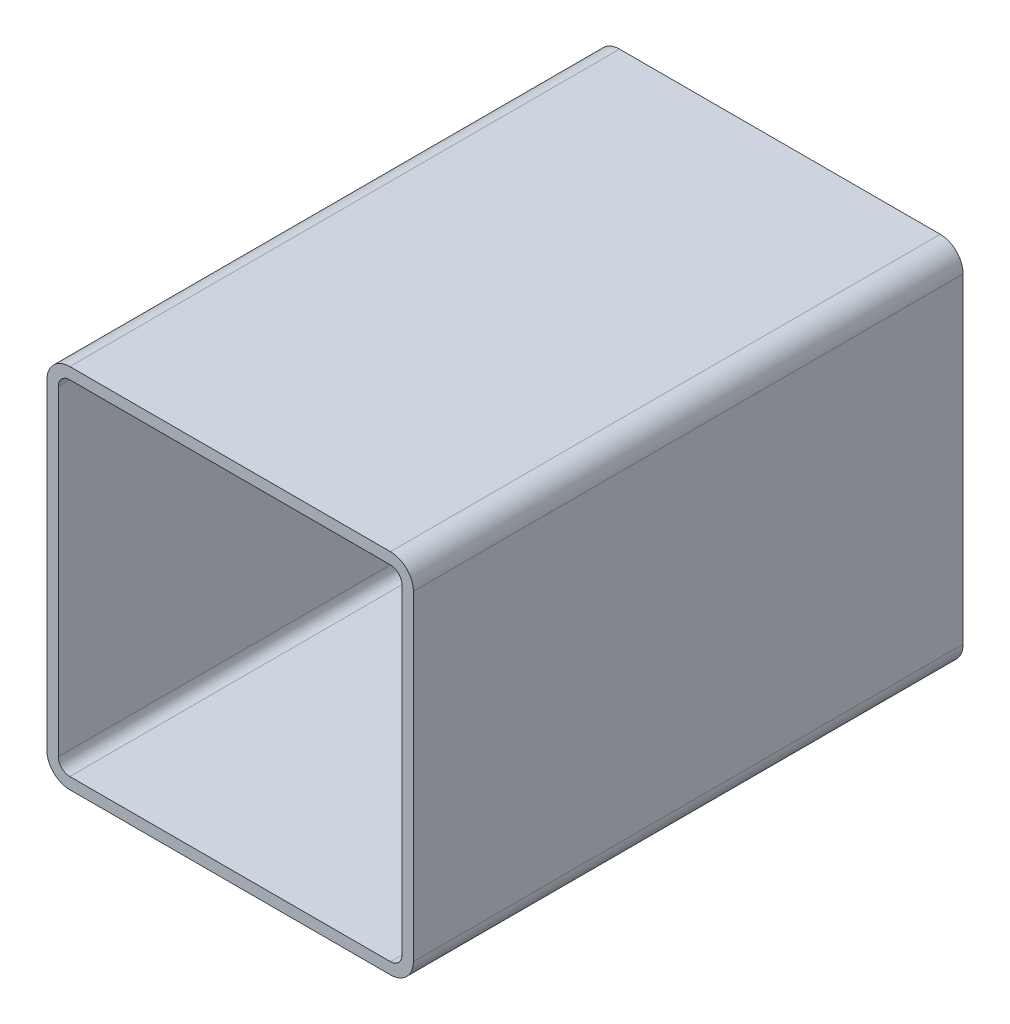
ISO-10303-21;
HEADER;
FILE_DESCRIPTION(('STEP AP214'),'2;1');
FILE_NAME('part.step','',(''),(''),'','','');
FILE_SCHEMA(('AUTOMOTIVE_DESIGN { 1 0 10303 214 1 1 1 1 }'));
ENDSEC;
DATA;
#1=APPLICATION_CONTEXT('core data for automotive mechanical design processes');
#2=APPLICATION_PROTOCOL_DEFINITION('international standard','automotive_design',2000,#1);
#3=PRODUCT_CONTEXT('',#1,'mechanical');
#4=PRODUCT('Part','Part','',(#3));
#5=PRODUCT_RELATED_PRODUCT_CATEGORY('part','',(#4));
#6=PRODUCT_DEFINITION_FORMATION('','',#4);
#7=PRODUCT_DEFINITION_CONTEXT('part definition',#1,'design');
#8=PRODUCT_DEFINITION('design','',#6,#7);
#9=PRODUCT_DEFINITION_SHAPE('','',#8);
#10=(LENGTH_UNIT() NAMED_UNIT(*) SI_UNIT(.MILLI.,.METRE.));
#11=(NAMED_UNIT(*) PLANE_ANGLE_UNIT() SI_UNIT($,.RADIAN.));
#12=(NAMED_UNIT(*) SI_UNIT($,.STERADIAN.) SOLID_ANGLE_UNIT());
#13=UNCERTAINTY_MEASURE_WITH_UNIT(LENGTH_MEASURE(1.E-05),#10,'distance_accuracy_value','');
#14=(GEOMETRIC_REPRESENTATION_CONTEXT(3) GLOBAL_UNCERTAINTY_ASSIGNED_CONTEXT((#13)) GLOBAL_UNIT_ASSIGNED_CONTEXT((#10,
#11,#12)) REPRESENTATION_CONTEXT('',''));
#15=CARTESIAN_POINT('',(0.,0.,0.));
#16=DIRECTION('',(0.,0.,1.));
#17=DIRECTION('',(1.,0.,0.));
#18=AXIS2_PLACEMENT_3D('',#15,#16,#17);
#19=CARTESIAN_POINT('',(14.0909404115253,192.466130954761,304.8));
#20=DIRECTION('',(0.,0.,1.));
#21=DIRECTION('',(1.,0.,0.));
#22=AXIS2_PLACEMENT_3D('',#19,#20,#21);
#23=PLANE('',#22);
#24=CARTESIAN_POINT('',(14.0909404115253,192.466130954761,304.8));
#25=DIRECTION('',(0.,0.,1.));
#26=DIRECTION('',(1.,0.,0.));
#27=AXIS2_PLACEMENT_3D('',#24,#25,#26);
#28=CIRCLE('',#27,12.7);
#29=CARTESIAN_POINT('',(14.0909404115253,205.166130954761,304.8));
#30=VERTEX_POINT('',#29);
#31=CARTESIAN_POINT('',(1.3909404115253,192.466130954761,304.8));
#32=VERTEX_POINT('',#31);
#33=EDGE_CURVE('E211',#30,#32,#28,.T.);
#34=ORIENTED_EDGE('',*,*,#33,.T.);
#35=DIRECTION('',(0.,-1.,0.));
#36=VECTOR('',#35,1.);
#37=CARTESIAN_POINT('',(1.3909404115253,14.6661309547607,304.8));
#38=LINE('',#37,#36);
#39=CARTESIAN_POINT('',(1.3909404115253,14.6661309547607,304.8));
#40=VERTEX_POINT('',#39);
#41=EDGE_CURVE('E214',#32,#40,#38,.T.);
#42=ORIENTED_EDGE('',*,*,#41,.T.);
#43=CARTESIAN_POINT('',(14.0909404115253,14.6661309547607,304.8));
#44=DIRECTION('',(0.,0.,1.));
#45=DIRECTION('',(1.,0.,0.));
#46=AXIS2_PLACEMENT_3D('',#43,#44,#45);
#47=CIRCLE('',#46,12.7);
#48=CARTESIAN_POINT('',(14.0909404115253,1.96613095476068,304.8));
#49=VERTEX_POINT('',#48);
#50=EDGE_CURVE('E217',#40,#49,#47,.T.);
#51=ORIENTED_EDGE('',*,*,#50,.T.);
#52=DIRECTION('',(1.,0.,0.));
#53=VECTOR('',#52,1.);
#54=CARTESIAN_POINT('',(191.890940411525,1.96613095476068,304.8));
#55=LINE('',#54,#53);
#56=CARTESIAN_POINT('',(191.890940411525,1.96613095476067,304.8));
#57=VERTEX_POINT('',#56);
#58=EDGE_CURVE('E219',#49,#57,#55,.T.);
#59=ORIENTED_EDGE('',*,*,#58,.T.);
#60=CARTESIAN_POINT('',(191.890940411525,14.6661309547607,304.8));
#61=DIRECTION('',(0.,0.,1.));
#62=DIRECTION('',(1.,0.,0.));
#63=AXIS2_PLACEMENT_3D('',#60,#61,#62);
#64=CIRCLE('',#63,12.7);
#65=CARTESIAN_POINT('',(204.590940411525,14.6661309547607,304.8));
#66=VERTEX_POINT('',#65);
#67=EDGE_CURVE('E221',#57,#66,#64,.T.);
#68=ORIENTED_EDGE('',*,*,#67,.T.);
#69=DIRECTION('',(0.,1.,0.));
#70=VECTOR('',#69,1.);
#71=CARTESIAN_POINT('',(204.590940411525,192.466130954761,304.8));
#72=LINE('',#71,#70);
#73=CARTESIAN_POINT('',(204.590940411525,192.466130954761,304.8));
#74=VERTEX_POINT('',#73);
#75=EDGE_CURVE('E223',#66,#74,#72,.T.);
#76=ORIENTED_EDGE('',*,*,#75,.T.);
#77=CARTESIAN_POINT('',(191.890940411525,192.466130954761,304.8));
#78=DIRECTION('',(0.,0.,1.));
#79=DIRECTION('',(1.,0.,0.));
#80=AXIS2_PLACEMENT_3D('',#77,#78,#79);
#81=CIRCLE('',#80,12.7);
#82=CARTESIAN_POINT('',(191.890940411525,205.166130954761,304.8));
#83=VERTEX_POINT('',#82);
#84=EDGE_CURVE('E225',#74,#83,#81,.T.);
#85=ORIENTED_EDGE('',*,*,#84,.T.);
#86=DIRECTION('',(-1.,0.,0.));
#87=VECTOR('',#86,1.);
#88=CARTESIAN_POINT('',(14.0909404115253,205.166130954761,304.8));
#89=LINE('',#88,#87);
#90=EDGE_CURVE('E227',#83,#30,#89,.T.);
#91=ORIENTED_EDGE('',*,*,#90,.T.);
#92=EDGE_LOOP('',(#34,#42,#51,#59,#68,#76,#85,#91));
#93=FACE_BOUND('',#92,.T.);
#94=DIRECTION('',(0.,-1.,0.));
#95=VECTOR('',#94,1.);
#96=CARTESIAN_POINT('',(7.7409404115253,14.6661309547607,304.8));
#97=LINE('',#96,#95);
#98=CARTESIAN_POINT('',(7.7409404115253,192.466130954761,304.8));
#99=VERTEX_POINT('',#98);
#100=CARTESIAN_POINT('',(7.7409404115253,14.6661309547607,304.8));
#101=VERTEX_POINT('',#100);
#102=EDGE_CURVE('E154',#99,#101,#97,.T.);
#103=ORIENTED_EDGE('',*,*,#102,.F.);
#104=CARTESIAN_POINT('',(14.0909404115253,192.466130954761,304.8));
#105=DIRECTION('',(0.,0.,1.));
#106=DIRECTION('',(1.,0.,0.));
#107=AXIS2_PLACEMENT_3D('',#104,#105,#106);
#108=CIRCLE('',#107,6.35000000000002);
#109=CARTESIAN_POINT('',(14.0909404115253,198.816130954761,304.8));
#110=VERTEX_POINT('',#109);
#111=EDGE_CURVE('E146',#110,#99,#108,.T.);
#112=ORIENTED_EDGE('',*,*,#111,.F.);
#113=DIRECTION('',(-1.,0.,0.));
#114=VECTOR('',#113,1.);
#115=CARTESIAN_POINT('',(14.0909404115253,198.816130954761,304.8));
#116=LINE('',#115,#114);
#117=CARTESIAN_POINT('',(191.890940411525,198.816130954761,304.8));
#118=VERTEX_POINT('',#117);
#119=EDGE_CURVE('E179',#118,#110,#116,.T.);
#120=ORIENTED_EDGE('',*,*,#119,.F.);
#121=CARTESIAN_POINT('',(191.890940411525,192.466130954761,304.8));
#122=DIRECTION('',(0.,0.,1.));
#123=DIRECTION('',(1.,0.,0.));
#124=AXIS2_PLACEMENT_3D('',#121,#122,#123);
#125=CIRCLE('',#124,6.35000000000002);
#126=CARTESIAN_POINT('',(198.240940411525,192.466130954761,304.8));
#127=VERTEX_POINT('',#126);
#128=EDGE_CURVE('E177',#127,#118,#125,.T.);
#129=ORIENTED_EDGE('',*,*,#128,.F.);
#130=DIRECTION('',(0.,1.,0.));
#131=VECTOR('',#130,1.);
#132=CARTESIAN_POINT('',(198.240940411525,192.466130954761,304.8));
#133=LINE('',#132,#131);
#134=CARTESIAN_POINT('',(198.240940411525,14.6661309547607,304.8));
#135=VERTEX_POINT('',#134);
#136=EDGE_CURVE('E175',#135,#127,#133,.T.);
#137=ORIENTED_EDGE('',*,*,#136,.F.);
#138=CARTESIAN_POINT('',(191.890940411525,14.6661309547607,304.8));
#139=DIRECTION('',(0.,0.,1.));
#140=DIRECTION('',(1.,0.,0.));
#141=AXIS2_PLACEMENT_3D('',#138,#139,#140);
#142=CIRCLE('',#141,6.35000000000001);
#143=CARTESIAN_POINT('',(191.890940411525,8.31613095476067,304.8));
#144=VERTEX_POINT('',#143);
#145=EDGE_CURVE('E173',#144,#135,#142,.T.);
#146=ORIENTED_EDGE('',*,*,#145,.F.);
#147=DIRECTION('',(1.,0.,0.));
#148=VECTOR('',#147,1.);
#149=CARTESIAN_POINT('',(191.890940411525,8.31613095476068,304.8));
#150=LINE('',#149,#148);
#151=CARTESIAN_POINT('',(14.0909404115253,8.31613095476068,304.8));
#152=VERTEX_POINT('',#151);
#153=EDGE_CURVE('E169',#152,#144,#150,.T.);
#154=ORIENTED_EDGE('',*,*,#153,.F.);
#155=CARTESIAN_POINT('',(14.0909404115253,14.6661309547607,304.8));
#156=DIRECTION('',(0.,0.,1.));
#157=DIRECTION('',(1.,0.,0.));
#158=AXIS2_PLACEMENT_3D('',#155,#156,#157);
#159=CIRCLE('',#158,6.35);
#160=EDGE_CURVE('E167',#101,#152,#159,.T.);
#161=ORIENTED_EDGE('',*,*,#160,.F.);
#162=EDGE_LOOP('',(#103,#112,#120,#129,#137,#146,#154,#161));
#163=FACE_BOUND('',#162,.T.);
#164=ADVANCED_FACE('F33',(#93,#163),#23,.T.);
#165=CARTESIAN_POINT('',(14.0909404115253,192.466130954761,0.));
#166=DIRECTION('',(0.,0.,1.));
#167=DIRECTION('',(1.,0.,0.));
#168=AXIS2_PLACEMENT_3D('',#165,#166,#167);
#169=PLANE('',#168);
#170=CARTESIAN_POINT('',(14.0909404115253,192.466130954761,0.));
#171=DIRECTION('',(0.,0.,1.));
#172=DIRECTION('',(1.,0.,0.));
#173=AXIS2_PLACEMENT_3D('',#170,#171,#172);
#174=CIRCLE('',#173,12.7);
#175=CARTESIAN_POINT('',(14.0909404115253,205.166130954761,0.));
#176=VERTEX_POINT('',#175);
#177=CARTESIAN_POINT('',(1.3909404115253,192.466130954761,0.));
#178=VERTEX_POINT('',#177);
#179=EDGE_CURVE('E162',#176,#178,#174,.T.);
#180=ORIENTED_EDGE('',*,*,#179,.F.);
#181=DIRECTION('',(-1.,0.,0.));
#182=VECTOR('',#181,1.);
#183=CARTESIAN_POINT('',(14.0909404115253,205.166130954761,0.));
#184=LINE('',#183,#182);
#185=CARTESIAN_POINT('',(191.890940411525,205.166130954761,0.));
#186=VERTEX_POINT('',#185);
#187=EDGE_CURVE('E215',#186,#176,#184,.T.);
#188=ORIENTED_EDGE('',*,*,#187,.F.);
#189=CARTESIAN_POINT('',(191.890940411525,192.466130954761,0.));
#190=DIRECTION('',(0.,0.,1.));
#191=DIRECTION('',(1.,0.,0.));
#192=AXIS2_PLACEMENT_3D('',#189,#190,#191);
#193=CIRCLE('',#192,12.7);
#194=CARTESIAN_POINT('',(204.590940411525,192.466130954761,0.));
#195=VERTEX_POINT('',#194);
#196=EDGE_CURVE('E242',#195,#186,#193,.T.);
#197=ORIENTED_EDGE('',*,*,#196,.F.);
#198=DIRECTION('',(0.,1.,0.));
#199=VECTOR('',#198,1.);
#200=CARTESIAN_POINT('',(204.590940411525,192.466130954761,0.));
#201=LINE('',#200,#199);
#202=CARTESIAN_POINT('',(204.590940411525,14.6661309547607,0.));
#203=VERTEX_POINT('',#202);
#204=EDGE_CURVE('E240',#203,#195,#201,.T.);
#205=ORIENTED_EDGE('',*,*,#204,.F.);
#206=CARTESIAN_POINT('',(191.890940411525,14.6661309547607,0.));
#207=DIRECTION('',(0.,0.,1.));
#208=DIRECTION('',(1.,0.,0.));
#209=AXIS2_PLACEMENT_3D('',#206,#207,#208);
#210=CIRCLE('',#209,12.7);
#211=CARTESIAN_POINT('',(191.890940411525,1.96613095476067,0.));
#212=VERTEX_POINT('',#211);
#213=EDGE_CURVE('E238',#212,#203,#210,.T.);
#214=ORIENTED_EDGE('',*,*,#213,.F.);
#215=DIRECTION('',(1.,0.,0.));
#216=VECTOR('',#215,1.);
#217=CARTESIAN_POINT('',(191.890940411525,1.96613095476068,0.));
#218=LINE('',#217,#216);
#219=CARTESIAN_POINT('',(14.0909404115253,1.96613095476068,0.));
#220=VERTEX_POINT('',#219);
#221=EDGE_CURVE('E236',#220,#212,#218,.T.);
#222=ORIENTED_EDGE('',*,*,#221,.F.);
#223=CARTESIAN_POINT('',(14.0909404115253,14.6661309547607,0.));
#224=DIRECTION('',(0.,0.,1.));
#225=DIRECTION('',(1.,0.,0.));
#226=AXIS2_PLACEMENT_3D('',#223,#224,#225);
#227=CIRCLE('',#226,12.7);
#228=CARTESIAN_POINT('',(1.3909404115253,14.6661309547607,0.));
#229=VERTEX_POINT('',#228);
#230=EDGE_CURVE('E234',#229,#220,#227,.T.);
#231=ORIENTED_EDGE('',*,*,#230,.F.);
#232=DIRECTION('',(0.,-1.,0.));
#233=VECTOR('',#232,1.);
#234=CARTESIAN_POINT('',(1.3909404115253,14.6661309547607,0.));
#235=LINE('',#234,#233);
#236=EDGE_CURVE('E232',#178,#229,#235,.T.);
#237=ORIENTED_EDGE('',*,*,#236,.F.);
#238=EDGE_LOOP('',(#180,#188,#197,#205,#214,#222,#231,#237));
#239=FACE_BOUND('',#238,.T.);
#240=CARTESIAN_POINT('',(14.0909404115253,192.466130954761,0.));
#241=DIRECTION('',(0.,0.,1.));
#242=DIRECTION('',(1.,0.,0.));
#243=AXIS2_PLACEMENT_3D('',#240,#241,#242);
#244=CIRCLE('',#243,6.35000000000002);
#245=CARTESIAN_POINT('',(14.0909404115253,198.816130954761,0.));
#246=VERTEX_POINT('',#245);
#247=CARTESIAN_POINT('',(7.7409404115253,192.466130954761,0.));
#248=VERTEX_POINT('',#247);
#249=EDGE_CURVE('E56',#246,#248,#244,.T.);
#250=ORIENTED_EDGE('',*,*,#249,.T.);
#251=DIRECTION('',(0.,-1.,0.));
#252=VECTOR('',#251,1.);
#253=CARTESIAN_POINT('',(7.7409404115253,14.6661309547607,0.));
#254=LINE('',#253,#252);
#255=CARTESIAN_POINT('',(7.7409404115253,14.6661309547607,0.));
#256=VERTEX_POINT('',#255);
#257=EDGE_CURVE('E161',#248,#256,#254,.T.);
#258=ORIENTED_EDGE('',*,*,#257,.T.);
#259=CARTESIAN_POINT('',(14.0909404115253,14.6661309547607,0.));
#260=DIRECTION('',(0.,0.,1.));
#261=DIRECTION('',(1.,0.,0.));
#262=AXIS2_PLACEMENT_3D('',#259,#260,#261);
#263=CIRCLE('',#262,6.35);
#264=CARTESIAN_POINT('',(14.0909404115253,8.31613095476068,0.));
#265=VERTEX_POINT('',#264);
#266=EDGE_CURVE('E183',#256,#265,#263,.T.);
#267=ORIENTED_EDGE('',*,*,#266,.T.);
#268=DIRECTION('',(1.,0.,0.));
#269=VECTOR('',#268,1.);
#270=CARTESIAN_POINT('',(191.890940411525,8.31613095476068,0.));
#271=LINE('',#270,#269);
#272=CARTESIAN_POINT('',(191.890940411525,8.31613095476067,0.));
#273=VERTEX_POINT('',#272);
#274=EDGE_CURVE('E186',#265,#273,#271,.T.);
#275=ORIENTED_EDGE('',*,*,#274,.T.);
#276=CARTESIAN_POINT('',(191.890940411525,14.6661309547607,0.));
#277=DIRECTION('',(0.,0.,1.));
#278=DIRECTION('',(1.,0.,0.));
#279=AXIS2_PLACEMENT_3D('',#276,#277,#278);
#280=CIRCLE('',#279,6.35000000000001);
#281=CARTESIAN_POINT('',(198.240940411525,14.6661309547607,0.));
#282=VERTEX_POINT('',#281);
#283=EDGE_CURVE('E189',#273,#282,#280,.T.);
#284=ORIENTED_EDGE('',*,*,#283,.T.);
#285=DIRECTION('',(0.,1.,0.));
#286=VECTOR('',#285,1.);
#287=CARTESIAN_POINT('',(198.240940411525,192.466130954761,0.));
#288=LINE('',#287,#286);
#289=CARTESIAN_POINT('',(198.240940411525,192.466130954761,0.));
#290=VERTEX_POINT('',#289);
#291=EDGE_CURVE('E192',#282,#290,#288,.T.);
#292=ORIENTED_EDGE('',*,*,#291,.T.);
#293=CARTESIAN_POINT('',(191.890940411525,192.466130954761,0.));
#294=DIRECTION('',(0.,0.,1.));
#295=DIRECTION('',(1.,0.,0.));
#296=AXIS2_PLACEMENT_3D('',#293,#294,#295);
#297=CIRCLE('',#296,6.35000000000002);
#298=CARTESIAN_POINT('',(191.890940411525,198.816130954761,0.));
#299=VERTEX_POINT('',#298);
#300=EDGE_CURVE('E195',#290,#299,#297,.T.);
#301=ORIENTED_EDGE('',*,*,#300,.T.);
#302=DIRECTION('',(-1.,0.,0.));
#303=VECTOR('',#302,1.);
#304=CARTESIAN_POINT('',(14.0909404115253,198.816130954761,0.));
#305=LINE('',#304,#303);
#306=EDGE_CURVE('E155',#299,#246,#305,.T.);
#307=ORIENTED_EDGE('',*,*,#306,.T.);
#308=EDGE_LOOP('',(#250,#258,#267,#275,#284,#292,#301,#307));
#309=FACE_BOUND('',#308,.T.);
#310=ADVANCED_FACE('F272',(#239,#309),#169,.F.);
#311=CARTESIAN_POINT('',(14.0909404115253,192.466130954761,304.8));
#312=DIRECTION('',(0.,0.,-1.));
#313=DIRECTION('',(-1.,0.,0.));
#314=AXIS2_PLACEMENT_3D('',#311,#312,#313);
#315=CYLINDRICAL_SURFACE('',#314,12.7);
#316=ORIENTED_EDGE('',*,*,#179,.T.);
#317=DIRECTION('',(0.,0.,-1.));
#318=VECTOR('',#317,1.);
#319=CARTESIAN_POINT('',(1.3909404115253,192.466130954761,304.8));
#320=LINE('',#319,#318);
#321=EDGE_CURVE('E11',#32,#178,#320,.T.);
#322=ORIENTED_EDGE('',*,*,#321,.F.);
#323=ORIENTED_EDGE('',*,*,#33,.F.);
#324=DIRECTION('',(0.,0.,-1.));
#325=VECTOR('',#324,1.);
#326=CARTESIAN_POINT('',(14.0909404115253,205.166130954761,304.8));
#327=LINE('',#326,#325);
#328=EDGE_CURVE('E229',#30,#176,#327,.T.);
#329=ORIENTED_EDGE('',*,*,#328,.T.);
#330=EDGE_LOOP('',(#316,#322,#323,#329));
#331=FACE_BOUND('',#330,.T.);
#332=ADVANCED_FACE('F35',(#331),#315,.T.);
#333=CARTESIAN_POINT('',(1.3909404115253,14.6661309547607,304.8));
#334=DIRECTION('',(1.,0.,0.));
#335=DIRECTION('',(0.,0.,-1.));
#336=AXIS2_PLACEMENT_3D('',#333,#334,#335);
#337=PLANE('',#336);
#338=ORIENTED_EDGE('',*,*,#236,.T.);
#339=DIRECTION('',(0.,0.,-1.));
#340=VECTOR('',#339,1.);
#341=CARTESIAN_POINT('',(1.3909404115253,14.6661309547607,304.8));
#342=LINE('',#341,#340);
#343=EDGE_CURVE('E41',#40,#229,#342,.T.);
#344=ORIENTED_EDGE('',*,*,#343,.F.);
#345=ORIENTED_EDGE('',*,*,#41,.F.);
#346=ORIENTED_EDGE('',*,*,#321,.T.);
#347=EDGE_LOOP('',(#338,#344,#345,#346));
#348=FACE_BOUND('',#347,.T.);
#349=ADVANCED_FACE('F289',(#348),#337,.F.);
#350=CARTESIAN_POINT('',(14.0909404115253,14.6661309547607,304.8));
#351=DIRECTION('',(0.,0.,-1.));
#352=DIRECTION('',(-1.,0.,0.));
#353=AXIS2_PLACEMENT_3D('',#350,#351,#352);
#354=CYLINDRICAL_SURFACE('',#353,12.7);
#355=ORIENTED_EDGE('',*,*,#230,.T.);
#356=DIRECTION('',(0.,0.,-1.));
#357=VECTOR('',#356,1.);
#358=CARTESIAN_POINT('',(14.0909404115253,1.96613095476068,304.8));
#359=LINE('',#358,#357);
#360=EDGE_CURVE('E259',#49,#220,#359,.T.);
#361=ORIENTED_EDGE('',*,*,#360,.F.);
#362=ORIENTED_EDGE('',*,*,#50,.F.);
#363=ORIENTED_EDGE('',*,*,#343,.T.);
#364=EDGE_LOOP('',(#355,#361,#362,#363));
#365=FACE_BOUND('',#364,.T.);
#366=ADVANCED_FACE('F266',(#365),#354,.T.);
#367=CARTESIAN_POINT('',(191.890940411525,1.96613095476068,304.8));
#368=DIRECTION('',(0.,1.,0.));
#369=DIRECTION('',(0.,0.,1.));
#370=AXIS2_PLACEMENT_3D('',#367,#368,#369);
#371=PLANE('',#370);
#372=ORIENTED_EDGE('',*,*,#221,.T.);
#373=DIRECTION('',(0.,0.,-1.));
#374=VECTOR('',#373,1.);
#375=CARTESIAN_POINT('',(191.890940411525,1.96613095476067,304.8));
#376=LINE('',#375,#374);
#377=EDGE_CURVE('E256',#57,#212,#376,.T.);
#378=ORIENTED_EDGE('',*,*,#377,.F.);
#379=ORIENTED_EDGE('',*,*,#58,.F.);
#380=ORIENTED_EDGE('',*,*,#360,.T.);
#381=EDGE_LOOP('',(#372,#378,#379,#380));
#382=FACE_BOUND('',#381,.T.);
#383=ADVANCED_FACE('F278',(#382),#371,.F.);
#384=CARTESIAN_POINT('',(191.890940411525,14.6661309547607,304.8));
#385=DIRECTION('',(0.,0.,-1.));
#386=DIRECTION('',(-1.,0.,0.));
#387=AXIS2_PLACEMENT_3D('',#384,#385,#386);
#388=CYLINDRICAL_SURFACE('',#387,12.7);
#389=ORIENTED_EDGE('',*,*,#213,.T.);
#390=DIRECTION('',(0.,0.,-1.));
#391=VECTOR('',#390,1.);
#392=CARTESIAN_POINT('',(204.590940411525,14.6661309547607,304.8));
#393=LINE('',#392,#391);
#394=EDGE_CURVE('E253',#66,#203,#393,.T.);
#395=ORIENTED_EDGE('',*,*,#394,.F.);
#396=ORIENTED_EDGE('',*,*,#67,.F.);
#397=ORIENTED_EDGE('',*,*,#377,.T.);
#398=EDGE_LOOP('',(#389,#395,#396,#397));
#399=FACE_BOUND('',#398,.T.);
#400=ADVANCED_FACE('F282',(#399),#388,.T.);
#401=CARTESIAN_POINT('',(204.590940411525,192.466130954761,304.8));
#402=DIRECTION('',(-1.,0.,0.));
#403=DIRECTION('',(0.,0.,1.));
#404=AXIS2_PLACEMENT_3D('',#401,#402,#403);
#405=PLANE('',#404);
#406=ORIENTED_EDGE('',*,*,#204,.T.);
#407=DIRECTION('',(0.,0.,-1.));
#408=VECTOR('',#407,1.);
#409=CARTESIAN_POINT('',(204.590940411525,192.466130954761,304.8));
#410=LINE('',#409,#408);
#411=EDGE_CURVE('E250',#74,#195,#410,.T.);
#412=ORIENTED_EDGE('',*,*,#411,.F.);
#413=ORIENTED_EDGE('',*,*,#75,.F.);
#414=ORIENTED_EDGE('',*,*,#394,.T.);
#415=EDGE_LOOP('',(#406,#412,#413,#414));
#416=FACE_BOUND('',#415,.T.);
#417=ADVANCED_FACE('F302',(#416),#405,.F.);
#418=CARTESIAN_POINT('',(191.890940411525,192.466130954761,304.8));
#419=DIRECTION('',(0.,0.,-1.));
#420=DIRECTION('',(-1.,0.,0.));
#421=AXIS2_PLACEMENT_3D('',#418,#419,#420);
#422=CYLINDRICAL_SURFACE('',#421,12.7);
#423=ORIENTED_EDGE('',*,*,#196,.T.);
#424=DIRECTION('',(0.,0.,-1.));
#425=VECTOR('',#424,1.);
#426=CARTESIAN_POINT('',(191.890940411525,205.166130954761,304.8));
#427=LINE('',#426,#425);
#428=EDGE_CURVE('E247',#83,#186,#427,.T.);
#429=ORIENTED_EDGE('',*,*,#428,.F.);
#430=ORIENTED_EDGE('',*,*,#84,.F.);
#431=ORIENTED_EDGE('',*,*,#411,.T.);
#432=EDGE_LOOP('',(#423,#429,#430,#431));
#433=FACE_BOUND('',#432,.T.);
#434=ADVANCED_FACE('F300',(#433),#422,.T.);
#435=CARTESIAN_POINT('',(14.0909404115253,205.166130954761,304.8));
#436=DIRECTION('',(0.,-1.,0.));
#437=DIRECTION('',(0.,0.,-1.));
#438=AXIS2_PLACEMENT_3D('',#435,#436,#437);
#439=PLANE('',#438);
#440=ORIENTED_EDGE('',*,*,#187,.T.);
#441=ORIENTED_EDGE('',*,*,#328,.F.);
#442=ORIENTED_EDGE('',*,*,#90,.F.);
#443=ORIENTED_EDGE('',*,*,#428,.T.);
#444=EDGE_LOOP('',(#440,#441,#442,#443));
#445=FACE_BOUND('',#444,.T.);
#446=ADVANCED_FACE('F295',(#445),#439,.F.);
#447=CARTESIAN_POINT('',(14.0909404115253,192.466130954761,304.8));
#448=DIRECTION('',(0.,0.,-1.));
#449=DIRECTION('',(-1.,0.,0.));
#450=AXIS2_PLACEMENT_3D('',#447,#448,#449);
#451=CYLINDRICAL_SURFACE('',#450,6.35000000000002);
#452=ORIENTED_EDGE('',*,*,#249,.F.);
#453=DIRECTION('',(0.,0.,-1.));
#454=VECTOR('',#453,1.);
#455=CARTESIAN_POINT('',(14.0909404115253,198.816130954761,304.8));
#456=LINE('',#455,#454);
#457=EDGE_CURVE('E150',#110,#246,#456,.T.);
#458=ORIENTED_EDGE('',*,*,#457,.F.);
#459=ORIENTED_EDGE('',*,*,#111,.T.);
#460=DIRECTION('',(0.,0.,-1.));
#461=VECTOR('',#460,1.);
#462=CARTESIAN_POINT('',(7.7409404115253,192.466130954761,304.8));
#463=LINE('',#462,#461);
#464=EDGE_CURVE('E149',#99,#248,#463,.T.);
#465=ORIENTED_EDGE('',*,*,#464,.T.);
#466=EDGE_LOOP('',(#452,#458,#459,#465));
#467=FACE_BOUND('',#466,.T.);
#468=ADVANCED_FACE('F148',(#467),#451,.F.);
#469=CARTESIAN_POINT('',(7.7409404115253,14.6661309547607,304.8));
#470=DIRECTION('',(1.,0.,0.));
#471=DIRECTION('',(0.,0.,-1.));
#472=AXIS2_PLACEMENT_3D('',#469,#470,#471);
#473=PLANE('',#472);
#474=ORIENTED_EDGE('',*,*,#257,.F.);
#475=ORIENTED_EDGE('',*,*,#464,.F.);
#476=ORIENTED_EDGE('',*,*,#102,.T.);
#477=DIRECTION('',(0.,0.,-1.));
#478=VECTOR('',#477,1.);
#479=CARTESIAN_POINT('',(7.7409404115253,14.6661309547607,304.8));
#480=LINE('',#479,#478);
#481=EDGE_CURVE('E163',#101,#256,#480,.T.);
#482=ORIENTED_EDGE('',*,*,#481,.T.);
#483=EDGE_LOOP('',(#474,#475,#476,#482));
#484=FACE_BOUND('',#483,.T.);
#485=ADVANCED_FACE('F158',(#484),#473,.T.);
#486=CARTESIAN_POINT('',(14.0909404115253,14.6661309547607,304.8));
#487=DIRECTION('',(0.,0.,-1.));
#488=DIRECTION('',(-1.,0.,0.));
#489=AXIS2_PLACEMENT_3D('',#486,#487,#488);
#490=CYLINDRICAL_SURFACE('',#489,6.35);
#491=ORIENTED_EDGE('',*,*,#266,.F.);
#492=ORIENTED_EDGE('',*,*,#481,.F.);
#493=ORIENTED_EDGE('',*,*,#160,.T.);
#494=DIRECTION('',(0.,0.,-1.));
#495=VECTOR('',#494,1.);
#496=CARTESIAN_POINT('',(14.0909404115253,8.31613095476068,304.8));
#497=LINE('',#496,#495);
#498=EDGE_CURVE('E208',#152,#265,#497,.T.);
#499=ORIENTED_EDGE('',*,*,#498,.T.);
#500=EDGE_LOOP('',(#491,#492,#493,#499));
#501=FACE_BOUND('',#500,.T.);
#502=ADVANCED_FACE('F327',(#501),#490,.F.);
#503=CARTESIAN_POINT('',(191.890940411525,8.31613095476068,304.8));
#504=DIRECTION('',(0.,1.,0.));
#505=DIRECTION('',(0.,0.,1.));
#506=AXIS2_PLACEMENT_3D('',#503,#504,#505);
#507=PLANE('',#506);
#508=ORIENTED_EDGE('',*,*,#274,.F.);
#509=ORIENTED_EDGE('',*,*,#498,.F.);
#510=ORIENTED_EDGE('',*,*,#153,.T.);
#511=DIRECTION('',(0.,0.,-1.));
#512=VECTOR('',#511,1.);
#513=CARTESIAN_POINT('',(191.890940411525,8.31613095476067,304.8));
#514=LINE('',#513,#512);
#515=EDGE_CURVE('E206',#144,#273,#514,.T.);
#516=ORIENTED_EDGE('',*,*,#515,.T.);
#517=EDGE_LOOP('',(#508,#509,#510,#516));
#518=FACE_BOUND('',#517,.T.);
#519=ADVANCED_FACE('F331',(#518),#507,.T.);
#520=CARTESIAN_POINT('',(191.890940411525,14.6661309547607,304.8));
#521=DIRECTION('',(0.,0.,-1.));
#522=DIRECTION('',(-1.,0.,0.));
#523=AXIS2_PLACEMENT_3D('',#520,#521,#522);
#524=CYLINDRICAL_SURFACE('',#523,6.35000000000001);
#525=ORIENTED_EDGE('',*,*,#283,.F.);
#526=ORIENTED_EDGE('',*,*,#515,.F.);
#527=ORIENTED_EDGE('',*,*,#145,.T.);
#528=DIRECTION('',(0.,0.,-1.));
#529=VECTOR('',#528,1.);
#530=CARTESIAN_POINT('',(198.240940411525,14.6661309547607,304.8));
#531=LINE('',#530,#529);
#532=EDGE_CURVE('E204',#135,#282,#531,.T.);
#533=ORIENTED_EDGE('',*,*,#532,.T.);
#534=EDGE_LOOP('',(#525,#526,#527,#533));
#535=FACE_BOUND('',#534,.T.);
#536=ADVANCED_FACE('F337',(#535),#524,.F.);
#537=CARTESIAN_POINT('',(198.240940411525,192.466130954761,304.8));
#538=DIRECTION('',(-1.,0.,0.));
#539=DIRECTION('',(0.,0.,1.));
#540=AXIS2_PLACEMENT_3D('',#537,#538,#539);
#541=PLANE('',#540);
#542=ORIENTED_EDGE('',*,*,#291,.F.);
#543=ORIENTED_EDGE('',*,*,#532,.F.);
#544=ORIENTED_EDGE('',*,*,#136,.T.);
#545=DIRECTION('',(0.,0.,-1.));
#546=VECTOR('',#545,1.);
#547=CARTESIAN_POINT('',(198.240940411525,192.466130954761,304.8));
#548=LINE('',#547,#546);
#549=EDGE_CURVE('E202',#127,#290,#548,.T.);
#550=ORIENTED_EDGE('',*,*,#549,.T.);
#551=EDGE_LOOP('',(#542,#543,#544,#550));
#552=FACE_BOUND('',#551,.T.);
#553=ADVANCED_FACE('F341',(#552),#541,.T.);
#554=CARTESIAN_POINT('',(191.890940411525,192.466130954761,304.8));
#555=DIRECTION('',(0.,0.,-1.));
#556=DIRECTION('',(-1.,0.,0.));
#557=AXIS2_PLACEMENT_3D('',#554,#555,#556);
#558=CYLINDRICAL_SURFACE('',#557,6.35000000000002);
#559=ORIENTED_EDGE('',*,*,#300,.F.);
#560=ORIENTED_EDGE('',*,*,#549,.F.);
#561=ORIENTED_EDGE('',*,*,#128,.T.);
#562=DIRECTION('',(0.,0.,-1.));
#563=VECTOR('',#562,1.);
#564=CARTESIAN_POINT('',(191.890940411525,198.816130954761,304.8));
#565=LINE('',#564,#563);
#566=EDGE_CURVE('E48',#118,#299,#565,.T.);
#567=ORIENTED_EDGE('',*,*,#566,.T.);
#568=EDGE_LOOP('',(#559,#560,#561,#567));
#569=FACE_BOUND('',#568,.T.);
#570=ADVANCED_FACE('F345',(#569),#558,.F.);
#571=CARTESIAN_POINT('',(14.0909404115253,198.816130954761,304.8));
#572=DIRECTION('',(0.,-1.,0.));
#573=DIRECTION('',(0.,0.,-1.));
#574=AXIS2_PLACEMENT_3D('',#571,#572,#573);
#575=PLANE('',#574);
#576=ORIENTED_EDGE('',*,*,#306,.F.);
#577=ORIENTED_EDGE('',*,*,#566,.F.);
#578=ORIENTED_EDGE('',*,*,#119,.T.);
#579=ORIENTED_EDGE('',*,*,#457,.T.);
#580=EDGE_LOOP('',(#576,#577,#578,#579));
#581=FACE_BOUND('',#580,.T.);
#582=ADVANCED_FACE('F349',(#581),#575,.T.);
#583=CLOSED_SHELL('',(#164,#310,#332,#349,#366,#383,#400,#417,#434,#446,#468,#485,#502,#519,
#536,#553,#570,#582));
#584=MANIFOLD_SOLID_BREP('B2',#583);
#585=ADVANCED_BREP_SHAPE_REPRESENTATION('',(#18,#584),#14);
#586=SHAPE_DEFINITION_REPRESENTATION(#9,#585);
ENDSEC;
END-ISO-10303-21;
